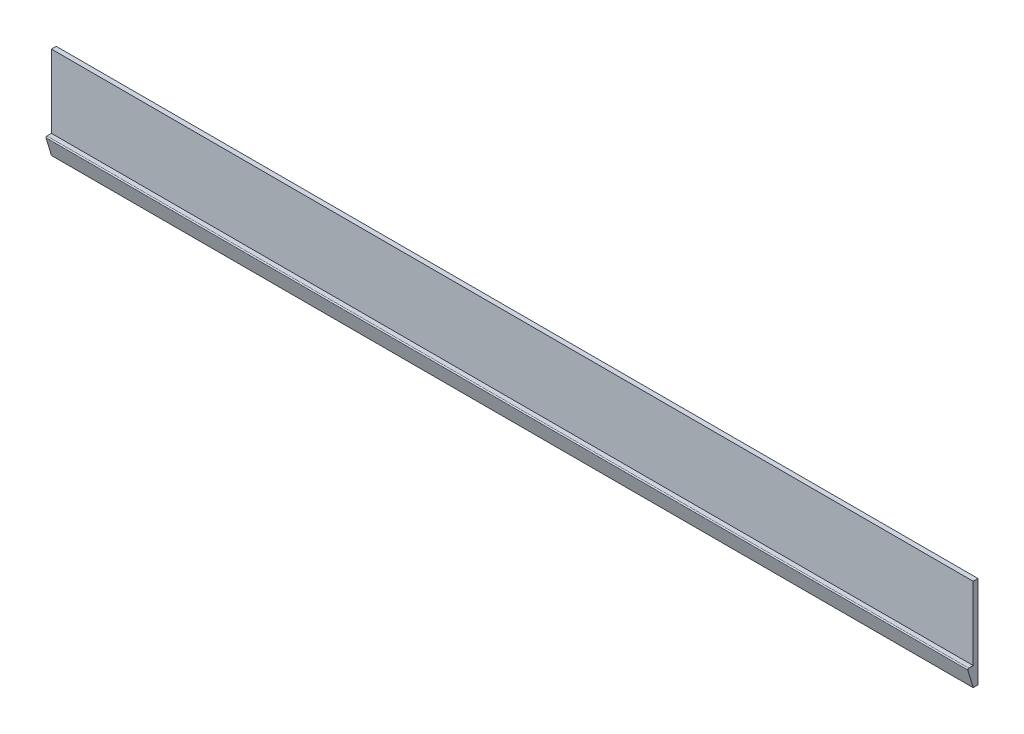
from build123d import *

# Parameters (mm, degrees)
BOSS_EXTRUDE1_DEPTH = 240
FILLET1_R           = 0.5


with BuildPart() as part:
    # Sketch1 → Boss-Extrude1 (new, symmetric)
    with BuildSketch(Plane(origin=(0, 0, 0), x_dir=(0, 0, -1), z_dir=(1, 0, 0))):
        Polygon((-1.25, -14), (-4.25, -14), (-1.25, -24), (1.25, -24), (1.25, 24), (-1.25, 24), align=None)
    extrude(amount=BOSS_EXTRUDE1_DEPTH, both=True)

    # Fillet1
    fillet1_edges = [part.edges().sort_by_distance(p)[0] for p in [
        (0, -14, 4.25),
    ]]
    fillet(fillet1_edges, radius=FILLET1_R)


solid = part.part
